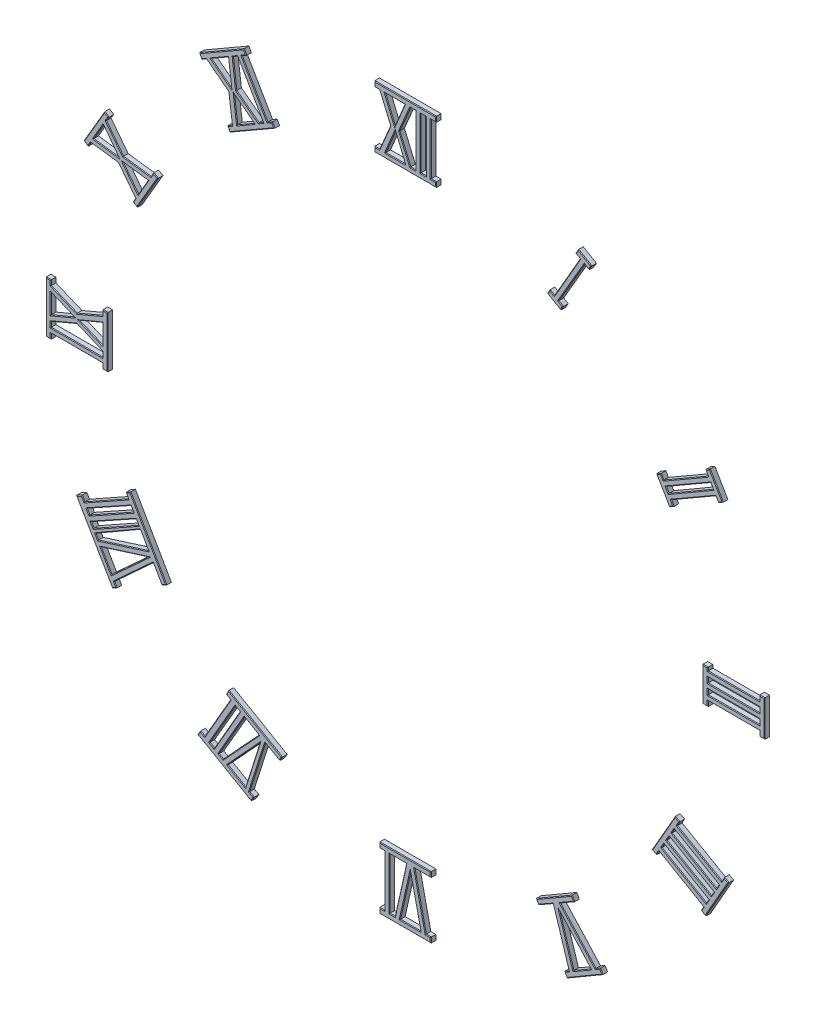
from build123d import *

# Parameters (mm, degrees)
SKETCH_1_W         = 2.0336
SKETCH_1_H         = 19.9807
EXTRUDE_1_DEPTH    = 2
EXTRUDE_1_2_DEPTH  = 2
EXTRUDE_1_3_DEPTH  = 2
SKETCH_1_W_2       = 19.9811
SKETCH_1_H_2       = 2.0333
SKETCH_1_H_3       = 2.0335
EXTRUDE_1_4_DEPTH  = 2
EXTRUDE_1_5_DEPTH  = 2
EXTRUDE_1_6_DEPTH  = 2
EXTRUDE_1_7_DEPTH  = 2
EXTRUDE_1_8_DEPTH  = 2
EXTRUDE_1_9_DEPTH  = 2
EXTRUDE_1_10_DEPTH = 2
EXTRUDE_1_11_DEPTH = 2
EXTRUDE_1_12_DEPTH = 2
CHAMFER_1_SIZE     = 0.25
CHAMFER_2_SIZE     = 0.25
CHAMFER_3_SIZE     = 0.25
CHAMFER_4_SIZE     = 0.25
CHAMFER_5_SIZE     = 0.25
CHAMFER_6_SIZE     = 0.25
CHAMFER_7_SIZE     = 0.25
CHAMFER_8_SIZE     = 0.25
CHAMFER_9_SIZE     = 0.25
CHAMFER_10_SIZE    = 0.25
CHAMFER_11_SIZE    = 0.25
CHAMFER_12_SIZE    = 0.25


with BuildPart() as part:
    # Sketch 1 → Extrude 1 (new body)
    with BuildSketch(Plane.XY):
        Polygon((-11.8915, 140.6619), (12.0681, 140.6619), (12.0681, 138.6283), (10.0345, 138.6283), (10.0345, 118.6476), (12.0681, 118.6476), (12.0681, 116.7026), (-11.8915, 116.7026), (-11.8915, 118.6476), (-9.9462, 118.6476), (-5.7026, 128.6381), (-9.9462, 138.6283), (-11.8915, 138.6283), align=None)
        Polygon((-0.0444, 118.9128), (-0.0444, 118.6476), (-7.5591, 118.6476), (-3.7575, 127.7538), align=None, mode=Mode.SUBTRACT)
        Polygon((-3.9345, 129.5221), (-7.736, 138.6283), (-0.1327, 138.6283), align=None, mode=Mode.SUBTRACT)
        Polygon((-2.1661, 128.6381), (2.0775, 138.6283), (4.1111, 138.6283), (4.1111, 118.6476), (2.0775, 118.6476), align=None, mode=Mode.SUBTRACT)
        with Locations((7.0728, 128.63795)):
            Rectangle(SKETCH_1_W, SKETCH_1_H, mode=Mode.SUBTRACT)
    extrude(amount=EXTRUDE_1_DEPTH)

    # Chamfer 1
    chamfer_1_edges = [part.edges().sort_by_distance(p)[0] for p in [
        (-7.8244, 133.6332, 2),
        (-7.8244, 123.64285, 2),
        (-10.91885, 118.6476, 2),
        (-11.8915, 117.6751, 2),
        (0.0883, 116.7026, 2),
        (12.0681, 117.6751, 2),
        (11.0513, 118.6476, 2),
        (10.0345, 128.63795, 2),
        (11.0513, 138.6283, 2),
        (-1.90095, 123.3333, 2),
        (-5.6583, 123.2007, 2),
        (-3.80175, 118.6476, 2),
        (12.0681, 139.6451, 2),
        (-0.0444, 118.7802, 2),
        (-11.8915, 139.6451, 2),
        (0.0883, 140.6619, 2),
        (-2.0336, 134.0752, 2),
        (-3.93435, 138.6283, 2),
        (-5.83525, 134.0752, 2),
        (-0.0443, 123.64285, 2),
        (3.0943, 118.6476, 2),
        (4.1111, 128.63795, 2),
        (3.0943, 138.6283, 2),
        (-0.0443, 133.6332, 2),
        (-10.91885, 138.6283, 2),
        (7.0728, 138.6283, 2),
        (6.056, 128.63795, 2),
        (7.0728, 118.6476, 2),
        (8.0896, 128.63795, 2),
    ]]
    chamfer(chamfer_1_edges, length=CHAMFER_1_SIZE)


with BuildPart() as body_2:
    # Sketch 1 → Extrude 1 2 (new body)
    with BuildSketch(Plane.XY):
        Polygon((69.712, 119.7968), (71.3917, 118.7358), (72.3642, 120.5042), (67.2366, 123.51), (66.1757, 121.7419), (67.9438, 120.7694), (57.9534, 103.4408), (56.1851, 104.4133), (55.2126, 102.7336), (60.4287, 99.7276), (61.4015, 101.4074), (59.633, 102.4683), align=None)
    extrude(amount=EXTRUDE_1_2_DEPTH)

    # Chamfer 2
    chamfer_2_edges = [body_2.edges().sort_by_distance(p)[0] for p in [
        (71.87795, 119.62, 2),
        (69.8004, 122.0071, 2),
        (66.70615, 122.62595, 2),
        (67.05975, 121.25565, 2),
        (62.9486, 112.1051, 2),
        (57.06925, 103.92705, 2),
        (55.69885, 103.57345, 2),
        (57.82065, 101.2306, 2),
        (60.9151, 100.5675, 2),
        (60.51725, 101.93785, 2),
        (64.6725, 111.13255, 2),
        (70.55185, 119.2663, 2),
    ]]
    chamfer(chamfer_2_edges, length=CHAMFER_2_SIZE)


with BuildPart() as body_3:
    # Sketch 1 → Extrude 1 3 (new body)
    with BuildSketch(Plane.XY):
        Polygon((118.3379, 75.2377), (123.3774, 66.5735), (121.6094, 65.6009), (120.6367, 67.3692), (103.3083, 57.3787), (104.2806, 55.6104), (102.6008, 54.638), (97.5615, 63.3022), (99.3298, 64.2749), (100.3021, 62.5065), (117.6309, 72.497), (116.6582, 74.2652), align=None)
        Polygon((118.6032, 70.8172), (119.5759, 69.0491), (102.3357, 59.0584), (101.2748, 60.8267), align=None, mode=Mode.SUBTRACT)
    extrude(amount=EXTRUDE_1_3_DEPTH)

    # Chamfer 3
    chamfer_3_edges = [body_3.edges().sort_by_distance(p)[0] for p in [
        (108.9665, 67.50175, 2),
        (99.81595, 63.3907, 2),
        (98.44565, 63.78855, 2),
        (100.08115, 58.9701, 2),
        (103.4407, 55.1242, 2),
        (103.79445, 56.49455, 2),
        (111.9725, 62.37395, 2),
        (121.12305, 66.48505, 2),
        (122.4934, 66.0872, 2),
        (109.939, 65.82195, 2),
        (101.80525, 59.94255, 2),
        (110.9558, 64.05375, 2),
        (119.08955, 69.93315, 2),
        (120.85765, 70.9056, 2),
        (117.49805, 74.75145, 2),
        (117.14455, 73.3811, 2),
    ]]
    chamfer(chamfer_3_edges, length=CHAMFER_3_SIZE)


with BuildPart() as body_4:
    # Sketch 1 → Extrude 1 4 (new body)
    with BuildSketch(Plane.XY):
        Polygon((137.5233, -3.0062), (137.5233, -5.0395), (139.5566, -5.0395), (139.5566, 8.9293), (137.5233, 8.9293), (137.5233, 6.9845), (117.5422, 6.9845), (117.5422, 8.2222), (115.5089, 8.2222), (115.5089, -5.0395), (117.5422, -5.0395), (117.5422, -3.0062), align=None)
        with Locations((127.53275, 3.93415)):
            Rectangle(SKETCH_1_W_2, SKETCH_1_H_2, mode=Mode.SUBTRACT)
        with Locations((127.53275, -0.04445)):
            Rectangle(SKETCH_1_W_2, SKETCH_1_H_3, mode=Mode.SUBTRACT)
    extrude(amount=EXTRUDE_1_4_DEPTH)

    # Chamfer 4
    chamfer_4_edges = [body_4.edges().sort_by_distance(p)[0] for p in [
        (138.53995, -5.0395, 2),
        (139.5566, 1.9449, 2),
        (138.53995, 8.9293, 2),
        (137.5233, 7.9569, 2),
        (127.53275, 6.9845, 2),
        (117.5422, 7.60335, 2),
        (116.52555, 8.2222, 2),
        (115.5089, 1.59135, 2),
        (116.52555, -5.0395, 2),
        (127.53275, 4.9508, 2),
        (117.5422, 3.93415, 2),
        (127.53275, 2.9175, 2),
        (137.5233, 3.93415, 2),
        (117.5422, -4.02285, 2),
        (127.53275, -3.0062, 2),
        (127.53275, 0.9723, 2),
        (117.5422, -0.04445, 2),
        (127.53275, -1.0612, 2),
        (137.5233, -0.04445, 2),
        (137.5233, -4.02285, 2),
    ]]
    chamfer(chamfer_4_edges, length=CHAMFER_4_SIZE)


with BuildPart() as body_5:
    # Sketch 1 → Extrude 1 5 (new body)
    with BuildSketch(Plane.XY):
        Polygon((-105.6071, 53.0466), (-104.6345, 54.8147), (-111.2653, 63.3907), (-121.9631, 64.8052), (-123.0241, 63.0369), (-124.7039, 64.0979), (-116.6585, 77.89), (-114.9786, 76.8291), (-116.0395, 75.1493), (-109.4087, 66.485), (-98.6226, 65.0706), (-97.6501, 66.8387), (-95.8818, 65.8663), (-103.9273, 52.074), align=None)
        Polygon((-120.9022, 66.662), (-117.1005, 73.2043), (-111.0886, 65.3357), align=None, mode=Mode.SUBTRACT)
        Polygon((-103.5736, 56.6713), (-99.772, 63.2138), (-109.5856, 64.54), align=None, mode=Mode.SUBTRACT)
    extrude(amount=EXTRUDE_1_5_DEPTH)

    # Chamfer 11
    chamfer_11_edges = [body_5.edges().sort_by_distance(p)[0] for p in [
        (-96.76595, 66.3525, 2),
        (-98.13635, 65.95465, 2),
        (-104.01565, 65.7778, 2),
        (-112.7241, 70.81715, 2),
        (-115.50905, 75.9892, 2),
        (-115.81855, 77.35955, 2),
        (-120.6812, 70.99395, 2),
        (-123.864, 63.5674, 2),
        (-122.4936, 63.92105, 2),
        (-116.6142, 64.09795, 2),
        (-115.9954, 65.99885, 2),
        (-114.09455, 69.27, 2),
        (-119.00135, 69.93315, 2),
        (-104.7672, 52.5603, 2),
        (-107.9499, 59.1027, 2),
        (-105.1208, 53.93065, 2),
        (-106.5796, 60.60565, 2),
        (-101.6728, 59.94255, 2),
        (-104.6788, 63.8769, 2),
        (-99.90455, 58.97015, 2),
    ]]
    chamfer(chamfer_11_edges, length=CHAMFER_11_SIZE)


with BuildPart() as body_6:
    # Sketch 1 → Extrude 1 6 (new body)
    with BuildSketch(Plane.XY):
        Polygon((125.5879, -60.208), (116.6582, -75.8567), (114.8899, -74.7957), (115.8625, -73.116), (98.6223, -63.1255), (97.5615, -64.8054), (95.8817, -63.8328), (104.811, -48.2725), (106.5793, -49.245), (105.6067, -51.0133), (122.9355, -61.0037), (123.9078, -59.2355), align=None)
        Polygon((104.5458, -52.693), (121.8745, -62.6836), (120.9019, -64.4516), (103.5734, -54.4613), align=None, mode=Mode.SUBTRACT)
        Polygon((102.6008, -56.141), (119.9296, -66.1316), (118.8684, -67.8997), (101.54, -57.9094), align=None, mode=Mode.SUBTRACT)
        Polygon((100.5673, -59.6774), (117.896, -69.6679), (116.9234, -71.3478), (99.5949, -61.3574), align=None, mode=Mode.SUBTRACT)
    extrude(amount=EXTRUDE_1_6_DEPTH)

    # Chamfer 5
    chamfer_5_edges = [body_6.edges().sort_by_distance(p)[0] for p in [
        (114.2711, -56.0085, 2),
        (106.093, -50.12915, 2),
        (105.69515, -48.75875, 2),
        (100.34635, -56.05265, 2),
        (96.7216, -64.3191, 2),
        (98.0919, -63.96545, 2),
        (107.2424, -68.12075, 2),
        (115.3762, -73.95585, 2),
        (115.77405, -75.3262, 2),
        (104.0596, -53.57715, 2),
        (112.23765, -59.45645, 2),
        (121.3882, -63.5676, 2),
        (113.21015, -57.6883, 2),
        (121.12305, -68.03235, 2),
        (124.74785, -59.72175, 2),
        (102.0704, -57.0252, 2),
        (110.2042, -62.90455, 2),
        (119.399, -67.01565, 2),
        (111.2652, -61.1363, 2),
        (100.0811, -60.5174, 2),
        (108.25915, -66.3526, 2),
        (117.4097, -70.50785, 2),
        (109.23165, -64.67265, 2),
        (123.42165, -60.1196, 2),
    ]]
    chamfer(chamfer_5_edges, length=CHAMFER_5_SIZE)


with BuildPart() as body_7:
    # Sketch 1 → Extrude 1 7 (new body)
    with BuildSketch(Plane.XY):
        Polygon((63.6115, -120.858), (61.8433, -121.8306), (62.9043, -123.5987), (76.6965, -115.5532), (75.724, -113.8736), (73.9556, -114.846), (60.1636, -99.7277), (65.7335, -96.5449), (64.761, -94.7768), (50.8804, -102.822), (51.8531, -104.5019), (57.423, -101.3191), align=None)
        Polygon((65.38, -119.797), (59.8984, -102.3801), (72.1874, -115.9069), align=None, mode=Mode.SUBTRACT)
    extrude(amount=EXTRUDE_1_7_DEPTH)

    # Chamfer 6
    chamfer_6_edges = [body_7.edges().sort_by_distance(p)[0] for p in [
        (62.3738, -122.71465, 2),
        (69.8004, -119.57595, 2),
        (76.21025, -114.7134, 2),
        (74.8398, -114.3598, 2),
        (67.0596, -107.28685, 2),
        (62.94855, -98.1363, 2),
        (65.24725, -95.66085, 2),
        (57.8207, -98.7994, 2),
        (68.7837, -117.85195, 2),
        (66.0429, -109.1435, 2),
        (62.6392, -111.08855, 2),
        (51.36675, -103.66195, 2),
        (54.63805, -102.9105, 2),
        (60.51725, -111.08855, 2),
        (62.7274, -121.3443, 2),
    ]]
    chamfer(chamfer_6_edges, length=CHAMFER_6_SIZE)


with BuildPart() as body_8:
    # Sketch 1 → Extrude 1 8 (new body)
    with BuildSketch(Plane.XY):
        Polygon((-7.913, -116.2607), (-9.9462, -116.2607), (-9.9462, -114.2271), (10.0345, -114.2271), (10.0345, -116.2607), (3.6689, -116.2607), (8.0896, -136.2414), (10.0345, -136.2414), (10.0345, -138.275), (-9.9462, -138.275), (-9.9462, -136.2414), (-7.913, -136.2414), align=None)
        Polygon((-1.901, -136.2414), (2.0775, -118.4709), (6.056, -136.2414), align=None, mode=Mode.SUBTRACT)
        Polygon((-3.9345, -136.2414), (-5.9677, -136.2414), (-5.9677, -116.2607), (0.4861, -116.2607), align=None, mode=Mode.SUBTRACT)
    extrude(amount=EXTRUDE_1_8_DEPTH)

    # Chamfer 7
    chamfer_7_edges = [body_8.edges().sort_by_distance(p)[0] for p in [
        (-9.9462, -137.2582, 2),
        (0.04415, -138.275, 2),
        (10.0345, -137.2582, 2),
        (9.06205, -136.2414, 2),
        (5.87925, -126.25105, 2),
        (6.8517, -116.2607, 2),
        (10.0345, -115.2439, 2),
        (0.04415, -114.2271, 2),
        (2.0775, -136.2414, 2),
        (4.06675, -127.35615, 2),
        (0.08825, -127.35615, 2),
        (-9.9462, -115.2439, 2),
        (-8.9296, -116.2607, 2),
        (-7.913, -126.25105, 2),
        (-1.7242, -126.25105, 2),
        (-2.7408, -116.2607, 2),
        (-5.9677, -126.25105, 2),
        (-4.9511, -136.2414, 2),
        (-8.9296, -136.2414, 2),
    ]]
    chamfer(chamfer_7_edges, length=CHAMFER_7_SIZE)


with BuildPart() as body_9:
    # Sketch 1 → Extrude 1 9 (new body)
    with BuildSketch(Plane.XY):
        Polygon((-47.6978, -104.5903), (-48.6703, -106.2701), (-54.2402, -103.0873), (-60.429, -122.6263), (-58.6608, -123.5987), (-59.7219, -125.3669), (-80.4983, -113.343), (-79.4374, -111.6632), (-77.7576, -112.6357), (-67.7671, -95.3072), (-69.447, -94.3346), (-68.4746, -92.5664), align=None)
        Polygon((-70.5963, -116.7026), (-72.2761, -115.7301), (-62.2857, -98.4016), (-56.7158, -101.6728), align=None, mode=Mode.SUBTRACT)
        Polygon((-61.932, -121.742), (-56.4505, -104.3252), (-68.828, -117.7635), align=None, mode=Mode.SUBTRACT)
        Polygon((-64.0538, -97.429), (-65.8221, -96.4564), (-75.8126, -113.6967), (-74.0445, -114.7575), align=None, mode=Mode.SUBTRACT)
    extrude(amount=EXTRUDE_1_9_DEPTH)

    # Chamfer 8
    chamfer_8_edges = [body_9.edges().sort_by_distance(p)[0] for p in [
        (-68.60705, -94.8209, 2),
        (-72.76235, -103.97145, 2),
        (-78.5975, -112.14945, 2),
        (-79.96785, -112.5031, 2),
        (-70.1101, -119.35495, 2),
        (-59.19135, -124.4828, 2),
        (-59.5449, -123.1125, 2),
        (-57.3346, -112.8568, 2),
        (-51.45525, -104.6787, 2),
        (-63.65605, -109.1877, 2),
        (-59.50075, -100.0372, 2),
        (-67.2809, -107.06585, 2),
        (-71.4362, -116.21635, 2),
        (-48.18405, -105.4302, 2),
        (-58.0862, -98.57835, 2),
        (-65.38, -119.75275, 2),
        (-59.19125, -113.0336, 2),
        (-62.63925, -111.04435, 2),
        (-69.04915, -106.09325, 2),
        (-64.93795, -96.9427, 2),
        (-70.81735, -105.07655, 2),
        (-74.92855, -114.2271, 2),
        (-68.9608, -93.4505, 2),
    ]]
    chamfer(chamfer_8_edges, length=CHAMFER_8_SIZE)


with BuildPart() as body_10:
    # Sketch 1 → Extrude 1 10 (new body)
    with BuildSketch(Plane.XY):
        Polygon((-94.3789, -70.1984), (-97.7384, -64.275), (-112.8567, -78.1553), (-111.8843, -79.8352), (-113.5641, -80.8077), (-127.6215, -56.5832), (-125.4112, -55.4338), (-124.4387, -57.202), (-107.3753, -47.6536), (-108.3478, -45.8854), (-106.5796, -44.9129), (-92.6107, -69.2258), align=None)
        Polygon((-99.5951, -61.1805), (-102.7779, -55.6106), (-120.1065, -65.6011), (-119.134, -67.3693), align=None, mode=Mode.SUBTRACT)
        Polygon((-122.4936, -60.65), (-123.4661, -58.8817), (-106.4028, -49.4219), (-105.3419, -51.1016), align=None, mode=Mode.SUBTRACT)
        Polygon((-118.0731, -69.1375), (-99.5951, -63.3023), (-113.9177, -76.3871), align=None, mode=Mode.SUBTRACT)
        Polygon((-104.3693, -52.8699), (-121.8747, -62.5951), (-120.8137, -64.275), (-103.3968, -54.5496), align=None, mode=Mode.SUBTRACT)
    extrude(amount=EXTRUDE_1_10_DEPTH)

    # Chamfer 9
    chamfer_9_edges = [body_10.edges().sort_by_distance(p)[0] for p in [
        (-107.4637, -45.39915, 2),
        (-107.86155, -46.7695, 2),
        (-115.907, -52.4278, 2),
        (-124.92495, -56.3179, 2),
        (-126.51635, -56.0085, 2),
        (-120.5928, -68.69545, 2),
        (-112.7242, -80.32145, 2),
        (-112.3705, -78.99525, 2),
        (-105.29755, -71.21515, 2),
        (-109.36455, -64.2749, 2),
        (-101.1865, -58.39555, 2),
        (-111.4422, -60.60585, 2),
        (-119.62025, -66.4852, 2),
        (-96.05865, -67.2367, 2),
        (-93.4948, -69.7121, 2),
        (-113.91775, -55.8758, 2),
        (-105.87235, -50.26175, 2),
        (-114.93445, -54.1518, 2),
        (-122.97985, -59.76585, 2),
        (-115.9954, -72.7623, 2),
        (-106.7564, -69.8447, 2),
        (-108.8341, -66.2199, 2),
        (-99.59515, -57.06935, 2),
        (-103.88305, -53.70975, 2),
        (-113.122, -57.7325, 2),
        (-121.3442, -63.43505, 2),
        (-112.10525, -59.4123, 2),
    ]]
    chamfer(chamfer_9_edges, length=CHAMFER_9_SIZE)


with BuildPart() as body_11:
    # Sketch 1 → Extrude 1 11 (new body)
    with BuildSketch(Plane.XY):
        Polygon((-139.3801, 10.963), (-137.4351, 10.963), (-137.4351, 9.0179), (-127.3562, 4.7741), (-117.3657, 9.0179), (-117.3657, 10.963), (-115.4207, 10.963), (-115.4207, -9.018), (-117.3657, -9.018), (-117.3657, -6.9847), (-137.4351, -6.9847), (-137.4351, -9.018), (-139.3801, -9.018), align=None)
        Polygon((-137.4351, 6.8076), (-137.4351, -0.7957), (-128.3287, 3.006), align=None, mode=Mode.SUBTRACT)
        Polygon((-137.4351, -3.0062), (-137.4351, -5.0395), (-117.3657, -5.0395), (-117.3657, -3.0062), (-127.3562, 1.2377), align=None, mode=Mode.SUBTRACT)
        Polygon((-117.3657, 6.6308), (-117.3657, -0.9725), (-126.4721, 2.8291), align=None, mode=Mode.SUBTRACT)
    extrude(amount=EXTRUDE_1_11_DEPTH)

    # Chamfer 10
    chamfer_10_edges = [body_11.edges().sort_by_distance(p)[0] for p in [
        (-137.4351, -8.00135, 2),
        (-127.4004, -6.9847, 2),
        (-117.3657, -8.00135, 2),
        (-116.3932, -9.018, 2),
        (-115.4207, 0.9725, 2),
        (-116.3932, 10.963, 2),
        (-117.3657, 9.99045, 2),
        (-122.36095, 6.896, 2),
        (-132.39565, 6.896, 2),
        (-132.8819, 4.9068, 2),
        (-137.4351, 3.00595, 2),
        (-132.8819, 1.10515, 2),
        (-137.4351, 9.99045, 2),
        (-139.3801, 0.9725, 2),
        (-138.4076, 10.963, 2),
        (-132.39565, -0.88425, 2),
        (-137.4351, -4.02285, 2),
        (-127.4004, -5.0395, 2),
        (-117.3657, -4.02285, 2),
        (-122.36095, -0.88425, 2),
        (-121.9189, 4.72995, 2),
        (-121.9189, 0.9283, 2),
        (-117.3657, 2.82915, 2),
        (-138.4076, -9.018, 2),
    ]]
    chamfer(chamfer_10_edges, length=CHAMFER_10_SIZE)


with BuildPart() as body_12:
    # Sketch 1 → Extrude 1 12 (new body)
    with BuildSketch(Plane.XY):
        Polygon((-51.5879, 106.9773), (-50.6155, 105.2975), (-67.944, 95.307), (-68.9165, 96.9868), (-67.1483, 98.0477), (-68.5628, 108.7456), (-77.1387, 115.3763), (-78.9069, 114.3155), (-79.8795, 116.0836), (-62.551, 126.074), (-61.5784, 124.3057), (-63.3467, 123.3333), (-53.3563, 106.0046), align=None)
        Polygon((-65.1148, 99.1972), (-58.4839, 102.9988), (-66.3526, 109.0107), align=None, mode=Mode.SUBTRACT)
        Polygon((-65.0264, 122.3608), (-55.0359, 105.0322), (-56.8042, 104.0597), (-65.4685, 110.6021), (-66.7946, 121.2998), align=None, mode=Mode.SUBTRACT)
        Polygon((-75.2821, 116.4373), (-68.6513, 120.239), (-67.4135, 110.4253), align=None, mode=Mode.SUBTRACT)
    extrude(amount=EXTRUDE_1_12_DEPTH)

    # Chamfer 12
    chamfer_12_edges = [body_12.edges().sort_by_distance(p)[0] for p in [
        (-62.46255, 123.8195, 2),
        (-62.0647, 125.18985, 2),
        (-71.21525, 121.0788, 2),
        (-79.3932, 115.19955, 2),
        (-78.0228, 114.8459, 2),
        (-72.85075, 112.06095, 2),
        (-67.85555, 103.39665, 2),
        (-68.0324, 97.51725, 2),
        (-68.43025, 96.1469, 2),
        (-65.7337, 104.10395, 2),
        (-61.79935, 101.098, 2),
        (-62.41825, 106.00475, 2),
        (-59.27975, 100.30225, 2),
        (-52.4721, 106.49095, 2),
        (-51.1017, 106.1374, 2),
        (-65.9105, 121.8303, 2),
        (-66.13155, 115.95095, 2),
        (-61.13635, 107.3309, 2),
        (-55.92005, 104.54595, 2),
        (-60.03115, 113.6965, 2),
        (-71.3478, 113.4313, 2),
        (-68.0324, 115.33215, 2),
        (-71.9667, 118.33815, 2),
        (-58.3515, 114.66895, 2),
    ]]
    chamfer(chamfer_12_edges, length=CHAMFER_12_SIZE)


solid = Compound([part.part, body_2.part, body_3.part, body_4.part, body_5.part, body_6.part, body_7.part, body_8.part, body_9.part, body_10.part, body_11.part, body_12.part])
